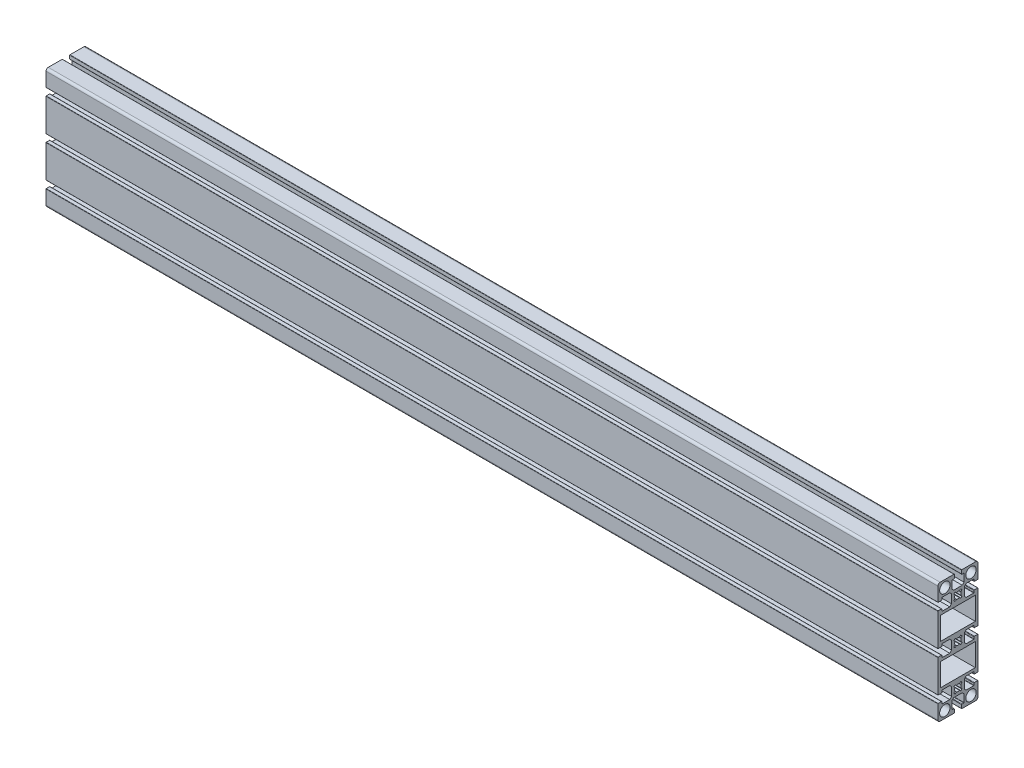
from build123d import *

# Parameters (mm, degrees)
MODEL12_R                        = 5.85000013
MODEL12_W                        = 38.999999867
MODEL12_H                        = 25.399994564
F_45_SARJA_1_0052_45X135_1_DEPTH = 1000


with BuildPart() as part:
    # Model12 → 45-sarja 1.0052 45X135_1 (new body)
    with BuildSketch(Plane(origin=(0, 0, 0), x_dir=(0, 0, -1), z_dir=(1, 0, 0))):
        with BuildLine():
            Line((-18.499999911, 40.900013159), (-22.199999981, 40.900013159))
            ThreePointArc((-22.199999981, 40.900013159), (-22.412132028, 40.812145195), (-22.5, 40.600013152))
            Line((-22.5, 40.600013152), (-22.5, 4.400009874))
            ThreePointArc((-22.5, 4.400009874), (-22.412131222, 4.187879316), (-22.199999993, 4.100012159))
            Line((-22.199999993, 4.100012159), (-18.499999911, 4.100012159))
            ThreePointArc((-18.499999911, 4.100012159), (-18.146446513, 4.246458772), (-17.9999999, 4.60001217))
            Line((-17.9999999, 4.60001217), (-17.9999999, 6.500017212))
            ThreePointArc((-17.9999999, 6.500017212), (-17.912130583, 6.712146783), (-17.699999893, 6.800013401))
            Line((-17.699999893, 6.800013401), (-9.199999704, 6.800013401))
            Line((-9.199999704, 6.800013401), (-7.19999966, 4.800013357))
            Line((-7.19999966, 4.800013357), (-7.19999966, -4.799988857))
            Line((-7.19999966, -4.799988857), (-9.199999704, -6.799988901))
            Line((-9.199999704, -6.799988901), (-17.699999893, -6.799988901))
            ThreePointArc((-17.699999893, -6.799988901), (-17.912131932, -6.712120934), (-17.9999999, -6.499988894))
            Line((-17.9999999, -6.499988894), (-17.9999999, -4.599986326))
            ThreePointArc((-17.9999999, -4.599986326), (-18.146447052, -4.246433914), (-18.499999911, -4.099987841))
            Line((-18.499999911, -4.099987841), (-22.199999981, -4.099987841))
            ThreePointArc((-22.199999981, -4.099987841), (-22.412132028, -4.187855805), (-22.5, -4.399987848))
            Line((-22.5, -4.399987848), (-22.5, -40.599991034))
            ThreePointArc((-22.5, -40.599991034), (-22.412131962, -40.812122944), (-22.199999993, -40.899990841))
            Line((-22.199999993, -40.899990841), (-18.499999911, -40.899990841))
            ThreePointArc((-18.499999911, -40.899990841), (-18.146446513, -40.753544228), (-17.9999999, -40.39999083))
            Line((-17.9999999, -40.39999083), (-17.9999999, -38.499991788))
            ThreePointArc((-17.9999999, -38.499991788), (-17.912131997, -38.287859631), (-17.699999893, -38.199991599))
            Line((-17.699999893, -38.199991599), (-9.199999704, -38.199991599))
            Line((-9.199999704, -38.199991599), (-7.19999966, -40.199991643))
            Line((-7.19999966, -40.199991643), (-7.19999966, -49.799989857))
            Line((-7.19999966, -49.799989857), (-9.199999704, -51.799990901))
            Line((-9.199999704, -51.799990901), (-17.699999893, -51.799990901))
            ThreePointArc((-17.699999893, -51.799990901), (-17.912131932, -51.712122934), (-17.9999999, -51.499990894))
            Line((-17.9999999, -51.499990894), (-17.9999999, -49.599990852))
            ThreePointArc((-17.9999999, -49.599990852), (-18.146446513, -49.246437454), (-18.499999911, -49.099990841))
            Line((-18.499999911, -49.099990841), (-22.199999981, -49.099990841))
            ThreePointArc((-22.199999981, -49.099990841), (-22.412132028, -49.187858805), (-22.5, -49.399990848))
            Line((-22.5, -49.399990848), (-22.5, -64.999991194))
            ThreePointArc((-22.5, -64.999991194), (-21.76777003, -66.767763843), (-19.999999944, -67.5))
            Line((-19.999999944, -67.5), (-4.399999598, -67.5))
            ThreePointArc((-4.399999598, -67.5), (-4.187867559, -67.412132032), (-4.099999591, -67.199999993))
            Line((-4.099999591, -67.199999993), (-4.099999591, -63.499999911))
            ThreePointArc((-4.099999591, -63.499999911), (-4.246446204, -63.146446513), (-4.599999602, -62.9999999))
            Line((-4.599999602, -62.9999999), (-6.499999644, -62.9999999))
            ThreePointArc((-6.499999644, -62.9999999), (-6.712131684, -62.912131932), (-6.799999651, -62.699999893))
            Line((-6.799999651, -62.699999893), (-6.799999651, -54.199999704))
            Line((-6.799999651, -54.199999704), (-4.799998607, -52.19999966))
            Line((-4.799998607, -52.19999966), (4.799999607, -52.19999966))
            Line((4.799999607, -52.19999966), (6.799999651, -54.199999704))
            Line((6.799999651, -54.199999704), (6.799999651, -62.699999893))
            ThreePointArc((6.799999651, -62.699999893), (6.712131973, -62.912131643), (6.500000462, -62.9999999))
            Line((6.500000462, -62.9999999), (4.600000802, -62.9999999))
            ThreePointArc((4.600000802, -62.9999999), (4.246447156, -63.146446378), (4.100000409, -63.499999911))
            Line((4.100000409, -63.499999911), (4.100000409, -67.199999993))
            ThreePointArc((4.100000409, -67.199999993), (4.187868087, -67.412131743), (4.399999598, -67.5))
            Line((4.399999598, -67.5), (19.999999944, -67.5))
            ThreePointArc((19.999999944, -67.5), (21.76777003, -66.767763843), (22.5, -64.999991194))
            Line((22.5, -64.999991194), (22.5, -49.399990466))
            ThreePointArc((22.5, -49.399990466), (22.412131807, -49.187858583), (22.199999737, -49.099990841))
            Line((22.199999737, -49.099990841), (18.499999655, -49.099990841))
            ThreePointArc((18.499999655, -49.099990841), (18.146446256, -49.246437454), (17.999999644, -49.599990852))
            Line((17.999999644, -49.599990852), (17.999999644, -51.499990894))
            ThreePointArc((17.999999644, -51.499990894), (17.912131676, -51.712122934), (17.699999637, -51.799990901))
            Line((17.699999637, -51.799990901), (9.200000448, -51.799990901))
            Line((9.200000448, -51.799990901), (7.200000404, -49.799989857))
            Line((7.200000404, -49.799989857), (7.200000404, -40.199991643))
            Line((7.200000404, -40.199991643), (9.200000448, -38.199991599))
            Line((9.200000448, -38.199991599), (17.699999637, -38.199991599))
            ThreePointArc((17.699999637, -38.199991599), (17.912131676, -38.287859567), (17.999999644, -38.499991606))
            Line((17.999999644, -38.499991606), (17.999999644, -40.399990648))
            ThreePointArc((17.999999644, -40.399990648), (18.146446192, -40.753544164), (18.499999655, -40.899990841))
            Line((18.499999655, -40.899990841), (22.2000005, -40.899990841))
            ThreePointArc((22.2000005, -40.899990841), (22.412132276, -40.81212263), (22.5, -40.599990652))
            Line((22.5, -40.599990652), (22.5, -4.399989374))
            ThreePointArc((22.5, -4.399989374), (22.412132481, -4.187856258), (22.199999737, -4.099987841))
            Line((22.199999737, -4.099987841), (18.499999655, -4.099987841))
            ThreePointArc((18.499999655, -4.099987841), (18.146446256, -4.246434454), (17.999999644, -4.599987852))
            Line((17.999999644, -4.599987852), (17.999999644, -6.499988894))
            ThreePointArc((17.999999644, -6.499988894), (17.912131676, -6.712120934), (17.699999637, -6.799988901))
            Line((17.699999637, -6.799988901), (9.200000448, -6.799988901))
            Line((9.200000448, -6.799988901), (7.200000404, -4.799988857))
            Line((7.200000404, -4.799988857), (7.200000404, 4.800013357))
            Line((7.200000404, 4.800013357), (9.200000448, 6.800013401))
            Line((9.200000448, 6.800013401), (17.699999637, 6.800013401))
            ThreePointArc((17.699999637, 6.800013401), (17.912131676, 6.712145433), (17.999999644, 6.500013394))
            Line((17.999999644, 6.500013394), (17.999999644, 4.600006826))
            ThreePointArc((17.999999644, 4.600006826), (18.146448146, 4.246456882), (18.499999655, 4.100012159))
            Line((18.499999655, 4.100012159), (22.2000005, 4.100012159))
            ThreePointArc((22.2000005, 4.100012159), (22.412130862, 4.187878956), (22.5, 4.400008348))
            Line((22.5, 4.400008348), (22.5, 40.600011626))
            ThreePointArc((22.5, 40.600011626), (22.412132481, 40.812144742), (22.199999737, 40.900013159))
            Line((22.199999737, 40.900013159), (18.499999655, 40.900013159))
            ThreePointArc((18.499999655, 40.900013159), (18.146446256, 40.753566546), (17.999999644, 40.400013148))
            Line((17.999999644, 40.400013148), (17.999999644, 38.500008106))
            ThreePointArc((17.999999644, 38.500008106), (17.912131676, 38.287876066), (17.699999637, 38.200008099))
            Line((17.699999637, 38.200008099), (9.200000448, 38.200008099))
            Line((9.200000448, 38.200008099), (7.200000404, 40.200008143))
            Line((7.200000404, 40.200008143), (7.200000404, 49.800014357))
            Line((7.200000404, 49.800014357), (9.200000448, 51.800014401))
            Line((9.200000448, 51.800014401), (17.699999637, 51.800014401))
            ThreePointArc((17.699999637, 51.800014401), (17.912131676, 51.712146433), (17.999999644, 51.500014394))
            Line((17.999999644, 51.500014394), (17.999999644, 49.600007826))
            ThreePointArc((17.999999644, 49.600007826), (18.146446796, 49.246455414), (18.499999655, 49.100009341))
            Line((18.499999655, 49.100009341), (22.2000005, 49.100009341))
            ThreePointArc((22.2000005, 49.100009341), (22.412132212, 49.187877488), (22.5, 49.400009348))
            Line((22.5, 49.400009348), (22.5, 65.000011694))
            ThreePointArc((22.5, 65.000011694), (21.767762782, 66.767771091), (19.999999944, 67.5))
            Line((19.999999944, 67.5), (4.399999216, 67.5))
            ThreePointArc((4.399999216, 67.5), (4.187867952, 67.412131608), (4.100000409, 67.199999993))
            Line((4.100000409, 67.199999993), (4.100000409, 63.499999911))
            ThreePointArc((4.100000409, 63.499999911), (4.246447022, 63.146446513), (4.60000042, 62.9999999))
            Line((4.60000042, 62.9999999), (6.500000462, 62.9999999))
            ThreePointArc((6.500000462, 62.9999999), (6.712131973, 62.912131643), (6.799999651, 62.699999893))
            Line((6.799999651, 62.699999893), (6.799999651, 54.199996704))
            Line((6.799999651, 54.199996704), (4.799999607, 52.19999666))
            Line((4.799999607, 52.19999666), (-4.799998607, 52.19999666))
            Line((-4.799998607, 52.19999666), (-6.799999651, 54.199996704))
            Line((-6.799999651, 54.199996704), (-6.799999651, 62.699999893))
            ThreePointArc((-6.799999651, 62.699999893), (-6.712131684, 62.912131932), (-6.499999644, 62.9999999))
            Line((-6.499999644, 62.9999999), (-4.599999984, 62.9999999))
            ThreePointArc((-4.599999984, 62.9999999), (-4.246446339, 63.146446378), (-4.099999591, 63.499999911))
            Line((-4.099999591, 63.499999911), (-4.099999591, 67.199996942))
            ThreePointArc((-4.099999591, 67.199996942), (-4.18786648, 67.412130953), (-4.399999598, 67.5))
            Line((-4.399999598, 67.5), (-19.999999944, 67.5))
            ThreePointArc((-19.999999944, 67.5), (-21.767762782, 66.767771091), (-22.5, 65.000011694))
            Line((-22.5, 65.000011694), (-22.5, 49.400010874))
            ThreePointArc((-22.5, 49.400010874), (-22.412131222, 49.187880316), (-22.199999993, 49.100013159))
            Line((-22.199999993, 49.100013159), (-18.499999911, 49.100013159))
            ThreePointArc((-18.499999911, 49.100013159), (-18.146446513, 49.246459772), (-17.9999999, 49.60001317))
            Line((-17.9999999, 49.60001317), (-17.9999999, 51.500018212))
            ThreePointArc((-17.9999999, 51.500018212), (-17.912130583, 51.712147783), (-17.699999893, 51.800014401))
            Line((-17.699999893, 51.800014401), (-9.199999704, 51.800014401))
            Line((-9.199999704, 51.800014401), (-7.19999966, 49.800014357))
            Line((-7.19999966, 49.800014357), (-7.19999966, 40.200008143))
            Line((-7.19999966, 40.200008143), (-9.199999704, 38.200008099))
            Line((-9.199999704, 38.200008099), (-17.699999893, 38.200008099))
            ThreePointArc((-17.699999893, 38.200008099), (-17.912131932, 38.287876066), (-17.9999999, 38.500008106))
            Line((-17.9999999, 38.500008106), (-17.9999999, 40.400014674))
            ThreePointArc((-17.9999999, 40.400014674), (-18.146447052, 40.753567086), (-18.499999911, 40.900013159))
        make_face()
        with Locations((-14.65, 59.65)):
            Circle(MODEL12_R, mode=Mode.SUBTRACT)
        with Locations((14.65, -59.65)):
            Circle(MODEL12_R, mode=Mode.SUBTRACT)
        with Locations((-14.65, -59.65)):
            Circle(MODEL12_R, mode=Mode.SUBTRACT)
        with Locations((14.65, 59.65)):
            Circle(MODEL12_R, mode=Mode.SUBTRACT)
        with BuildLine():
            Line((4.384061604, 48.394112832), (3.394112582, 49.384061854))
            ThreePointArc((3.394112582, 49.384061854), (3.181980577, 49.471929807), (2.969848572, 49.384061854))
            Line((2.969848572, 49.384061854), (1.949077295, 48.363290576))
            ThreePointArc((1.949077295, 48.363290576), (1.786690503, 48.279575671), (1.605855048, 48.305579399))
            ThreePointArc((1.605855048, 48.305579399), (-2.84e-07, 48.675000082), (-1.60585556, 48.305579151))
            ThreePointArc((-1.60585556, 48.305579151), (-1.786691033, 48.279575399), (-1.949077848, 48.363290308))
            Line((-1.949077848, 48.363290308), (-2.969848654, 49.384061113))
            ThreePointArc((-2.969848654, 49.384061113), (-3.181980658, 49.471929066), (-3.394112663, 49.384061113))
            Line((-3.394112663, 49.384061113), (-4.384061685, 48.394112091))
            ThreePointArc((-4.384061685, 48.394112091), (-4.471929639, 48.181980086), (-4.384061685, 47.969848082))
            Line((-4.384061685, 47.969848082), (-3.363290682, 46.949077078))
            ThreePointArc((-3.363290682, 46.949077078), (-3.279575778, 46.786690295), (-3.305579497, 46.605854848))
            ThreePointArc((-3.305579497, 46.605854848), (-3.675000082, 44.999999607), (-3.305579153, 43.394144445))
            ThreePointArc((-3.305579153, 43.394144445), (-3.279575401, 43.213308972), (-3.36329031, 43.050922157))
            Line((-3.36329031, 43.050922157), (-4.384061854, 42.030150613))
            ThreePointArc((-4.384061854, 42.030150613), (-4.471929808, 41.818018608), (-4.384061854, 41.605886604))
            Line((-4.384061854, 41.605886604), (-3.394112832, 40.615937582))
            ThreePointArc((-3.394112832, 40.615937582), (-3.181980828, 40.528069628), (-2.969848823, 40.615937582))
            Line((-2.969848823, 40.615937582), (-1.949077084, 41.636709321))
            ThreePointArc((-1.949077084, 41.636709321), (-1.7866903, 41.720424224), (-1.605854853, 41.694420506))
            ThreePointArc((-1.605854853, 41.694420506), (8.3e-08, 41.324999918), (1.605855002, 41.694420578))
            ThreePointArc((1.605855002, 41.694420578), (1.786690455, 41.720424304), (1.949077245, 41.636709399))
            Line((1.949077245, 41.636709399), (2.969848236, 40.615938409))
            ThreePointArc((2.969848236, 40.615938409), (3.181980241, 40.528070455), (3.394112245, 40.615938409))
            Line((3.394112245, 40.615938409), (4.384061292, 41.605887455))
            ThreePointArc((4.384061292, 41.605887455), (4.471929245, 41.81801946), (4.384061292, 42.030151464))
            Line((4.384061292, 42.030151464), (3.363290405, 43.050922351))
            ThreePointArc((3.363290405, 43.050922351), (3.279575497, 43.213309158), (3.30557924, 43.394144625))
            ThreePointArc((3.30557924, 43.394144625), (3.675000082, 44.999999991), (3.305579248, 46.605855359))
            ThreePointArc((3.305579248, 46.605855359), (3.279575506, 46.786690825), (3.363290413, 46.949077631))
            Line((3.363290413, 46.949077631), (4.384061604, 47.969848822))
            ThreePointArc((4.384061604, 47.969848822), (4.471929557, 48.181980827), (4.384061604, 48.394112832))
        make_face(mode=Mode.SUBTRACT)
        with Locations((-2.56e-07, 22.50001075)):
            Rectangle(MODEL12_W, MODEL12_H, mode=Mode.SUBTRACT)
        with BuildLine():
            Line((4.384061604, 3.394112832), (3.394112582, 4.384061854))
            ThreePointArc((3.394112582, 4.384061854), (3.181980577, 4.471929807), (2.969848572, 4.384061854))
            Line((2.969848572, 4.384061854), (1.949077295, 3.363290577))
            ThreePointArc((1.949077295, 3.363290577), (1.786690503, 3.279575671), (1.605855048, 3.305579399))
            ThreePointArc((1.605855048, 3.305579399), (-2.84e-07, 3.675000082), (-1.60585556, 3.305579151))
            ThreePointArc((-1.60585556, 3.305579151), (-1.786691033, 3.279575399), (-1.949077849, 3.363290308))
            Line((-1.949077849, 3.363290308), (-2.969848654, 4.384061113))
            ThreePointArc((-2.969848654, 4.384061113), (-3.181980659, 4.471929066), (-3.394112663, 4.384061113))
            Line((-3.394112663, 4.384061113), (-4.384061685, 3.394112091))
            ThreePointArc((-4.384061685, 3.394112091), (-4.471929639, 3.181980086), (-4.384061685, 2.969848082))
            Line((-4.384061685, 2.969848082), (-3.363290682, 1.949077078))
            ThreePointArc((-3.363290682, 1.949077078), (-3.279575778, 1.786690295), (-3.305579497, 1.605854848))
            ThreePointArc((-3.305579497, 1.605854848), (-3.675000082, -3.93e-07), (-3.305579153, -1.605855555))
            ThreePointArc((-3.305579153, -1.605855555), (-3.279575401, -1.786691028), (-3.36329031, -1.949077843))
            Line((-3.36329031, -1.949077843), (-4.384061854, -2.969849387))
            ThreePointArc((-4.384061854, -2.969849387), (-4.471929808, -3.181981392), (-4.384061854, -3.394113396))
            Line((-4.384061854, -3.394113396), (-3.394112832, -4.384062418))
            ThreePointArc((-3.394112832, -4.384062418), (-3.181980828, -4.471930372), (-2.969848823, -4.384062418))
            Line((-2.969848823, -4.384062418), (-1.949077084, -3.363290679))
            ThreePointArc((-1.949077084, -3.363290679), (-1.7866903, -3.279575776), (-1.605854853, -3.305579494))
            ThreePointArc((-1.605854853, -3.305579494), (8.3e-08, -3.675000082), (1.605855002, -3.305579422))
            ThreePointArc((1.605855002, -3.305579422), (1.786690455, -3.279575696), (1.949077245, -3.363290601))
            Line((1.949077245, -3.363290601), (2.969848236, -4.384061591))
            ThreePointArc((2.969848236, -4.384061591), (3.181980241, -4.471929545), (3.394112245, -4.384061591))
            Line((3.394112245, -4.384061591), (4.384061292, -3.394112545))
            ThreePointArc((4.384061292, -3.394112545), (4.471929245, -3.18198054), (4.384061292, -2.969848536))
            Line((4.384061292, -2.969848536), (3.363290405, -1.949077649))
            ThreePointArc((3.363290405, -1.949077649), (3.279575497, -1.786690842), (3.30557924, -1.605855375))
            ThreePointArc((3.30557924, -1.605855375), (3.675000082, -9e-09), (3.305579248, 1.605855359))
            ThreePointArc((3.305579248, 1.605855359), (3.279575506, 1.786690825), (3.363290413, 1.949077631))
            Line((3.363290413, 1.949077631), (4.384061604, 2.969848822))
            ThreePointArc((4.384061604, 2.969848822), (4.471929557, 3.181980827), (4.384061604, 3.394112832))
        make_face(mode=Mode.SUBTRACT)
        with Locations((-2.56e-07, -22.50001075)):
            Rectangle(MODEL12_W, MODEL12_H, mode=Mode.SUBTRACT)
        with BuildLine():
            Line((3.363290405, -43.050922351), (4.384061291, -42.030151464))
            ThreePointArc((4.384061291, -42.030151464), (4.471929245, -41.81801946), (4.384061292, -41.605887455))
            Line((4.384061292, -41.605887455), (3.394112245, -40.615938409))
            ThreePointArc((3.394112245, -40.615938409), (3.181980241, -40.528070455), (2.969848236, -40.615938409))
            Line((2.969848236, -40.615938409), (1.949077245, -41.636709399))
            ThreePointArc((1.949077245, -41.636709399), (1.786690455, -41.720424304), (1.605855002, -41.694420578))
            ThreePointArc((1.605855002, -41.694420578), (8.3e-08, -41.324999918), (-1.605854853, -41.694420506))
            ThreePointArc((-1.605854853, -41.694420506), (-1.7866903, -41.720424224), (-1.949077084, -41.636709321))
            Line((-1.949077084, -41.636709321), (-2.969848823, -40.615937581))
            ThreePointArc((-2.969848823, -40.615937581), (-3.181980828, -40.528069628), (-3.394112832, -40.615937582))
            Line((-3.394112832, -40.615937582), (-4.384061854, -41.605886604))
            ThreePointArc((-4.384061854, -41.605886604), (-4.471929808, -41.818018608), (-4.384061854, -42.030150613))
            Line((-4.384061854, -42.030150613), (-3.36329031, -43.050922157))
            ThreePointArc((-3.36329031, -43.050922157), (-3.279575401, -43.213308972), (-3.305579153, -43.394144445))
            ThreePointArc((-3.305579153, -43.394144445), (-3.675000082, -44.999999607), (-3.305579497, -46.605854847))
            ThreePointArc((-3.305579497, -46.605854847), (-3.279575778, -46.786690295), (-3.363290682, -46.949077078))
            Line((-3.363290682, -46.949077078), (-4.384061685, -47.969848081))
            ThreePointArc((-4.384061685, -47.969848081), (-4.471929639, -48.181980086), (-4.384061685, -48.394112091))
            Line((-4.384061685, -48.394112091), (-3.394112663, -49.384061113))
            ThreePointArc((-3.394112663, -49.384061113), (-3.181980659, -49.471929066), (-2.969848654, -49.384061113))
            Line((-2.969848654, -49.384061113), (-1.949077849, -48.363290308))
            ThreePointArc((-1.949077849, -48.363290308), (-1.786691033, -48.279575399), (-1.60585556, -48.305579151))
            ThreePointArc((-1.60585556, -48.305579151), (-2.84e-07, -48.675000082), (1.605855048, -48.305579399))
            ThreePointArc((1.605855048, -48.305579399), (1.786690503, -48.279575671), (1.949077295, -48.363290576))
            Line((1.949077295, -48.363290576), (2.969848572, -49.384061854))
            ThreePointArc((2.969848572, -49.384061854), (3.181980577, -49.471929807), (3.394112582, -49.384061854))
            Line((3.394112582, -49.384061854), (4.384061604, -48.394112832))
            ThreePointArc((4.384061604, -48.394112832), (4.471929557, -48.181980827), (4.384061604, -47.969848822))
            Line((4.384061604, -47.969848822), (3.363290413, -46.949077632))
            ThreePointArc((3.363290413, -46.949077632), (3.279575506, -46.786690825), (3.305579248, -46.605855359))
            ThreePointArc((3.305579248, -46.605855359), (3.675000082, -44.999999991), (3.30557924, -43.394144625))
            ThreePointArc((3.30557924, -43.394144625), (3.279575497, -43.213309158), (3.363290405, -43.050922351))
        make_face(mode=Mode.SUBTRACT)
    extrude(amount=F_45_SARJA_1_0052_45X135_1_DEPTH)


solid = part.part
